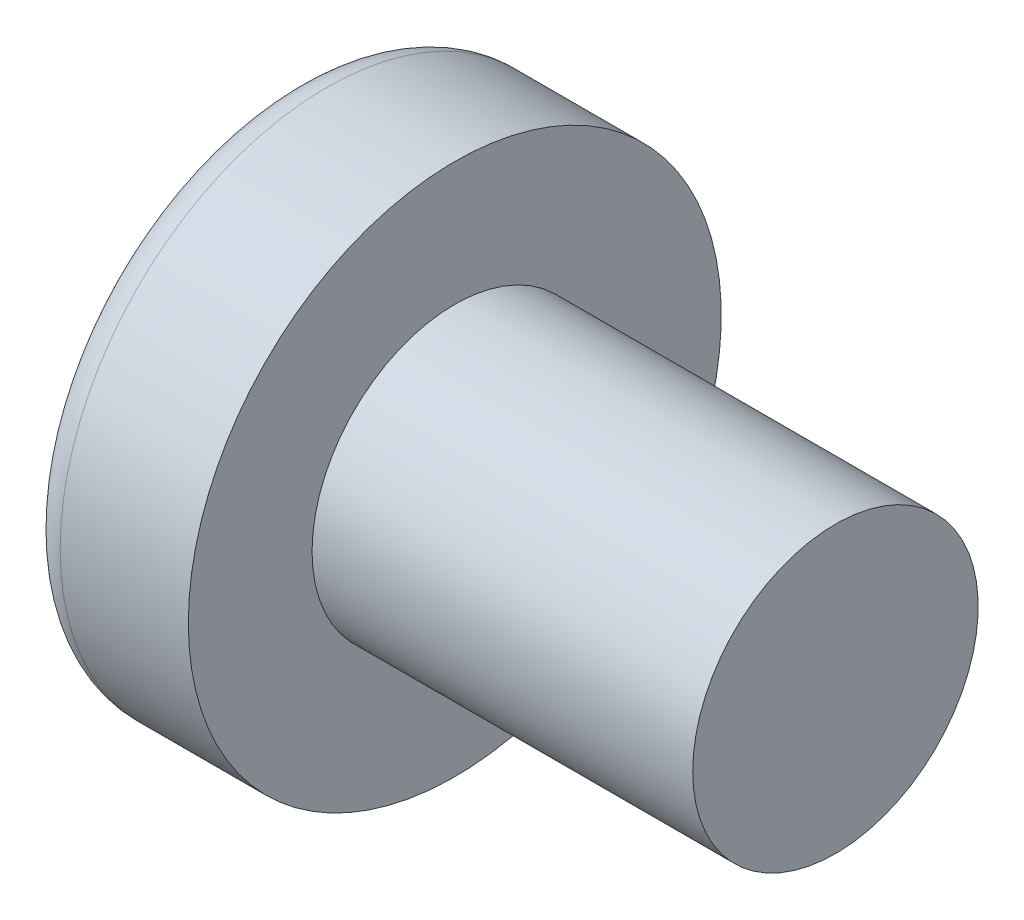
from build123d import *

# Parameters (mm, degrees)
CIRPATTERN1_COUNT = 2
CIRPATTERN1_ANGLE = 90


with BuildPart() as part:
    # BodySke → Base-Revolve (revolve)
    with BuildSketch(Plane.XY, mode=Mode.PRIVATE) as base_revolve_sk:
        with BuildLine():
            Line((2.4, 1.5), (2.4, 2.8))
            Line((2.4, 2.8), (1.053355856, 2.8))
            ThreePointArc((1.053355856, 2.8), (0.878072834, 2.754445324), (0.747150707, 2.629310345))
            ThreePointArc((0.747150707, 2.629310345), (0.190413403, 1.366702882), (0, 0))
            Line((0, 0), (6.4, 0))
            Line((6.4, 0), (6.4, 1.5))
            Line((6.4, 1.5), (2.4, 1.5))
        make_face()
    revolve(base_revolve_sk.sketch.rotate(Axis((-25.4, 0, 0), (1, 0, 0)), 90), axis=Axis((-25.4, 0, 0), (1, 0, 0)))

    # Sketch3 → Cut-Loft1 section 0
    with BuildSketch(Plane(origin=(0, 0, 0), x_dir=(0, 0, -1), z_dir=(1, 0, 0))):
        with BuildLine():
            Line((0.37, -1.45), (-0.37, -1.45))
            Line((-0.37, -1.45), (-0.37, 1.45))
            Line((-0.37, 1.45), (0.37, 1.45))
            Line((0.37, 1.45), (0.37, -1.45))
        make_face()
    # Sketch4 → Cut-Loft1 section 1
    with BuildSketch(Plane(origin=(1.76, 0, 0), x_dir=(0, 0, -1), z_dir=(1, 0, 0))):
        with BuildLine():
            Line((0.185, -0.185), (-0.185, -0.185))
            Line((-0.185, -0.185), (-0.185, 0.185))
            Line((-0.185, 0.185), (0.185, 0.185))
            Line((0.185, 0.185), (0.185, -0.185))
        make_face()
    cut_loft1 = loft(mode=Mode.SUBTRACT)

    # CirPattern1: Cut-Loft1 ×2 about axis
    cirpattern1_axis = Axis((0, 0, 0), (1, 0, 0))
    for i in range(1, CIRPATTERN1_COUNT):
        add(cut_loft1.rotate(cirpattern1_axis, i * CIRPATTERN1_ANGLE / (CIRPATTERN1_COUNT - 1)), mode=Mode.SUBTRACT)


solid = part.part
